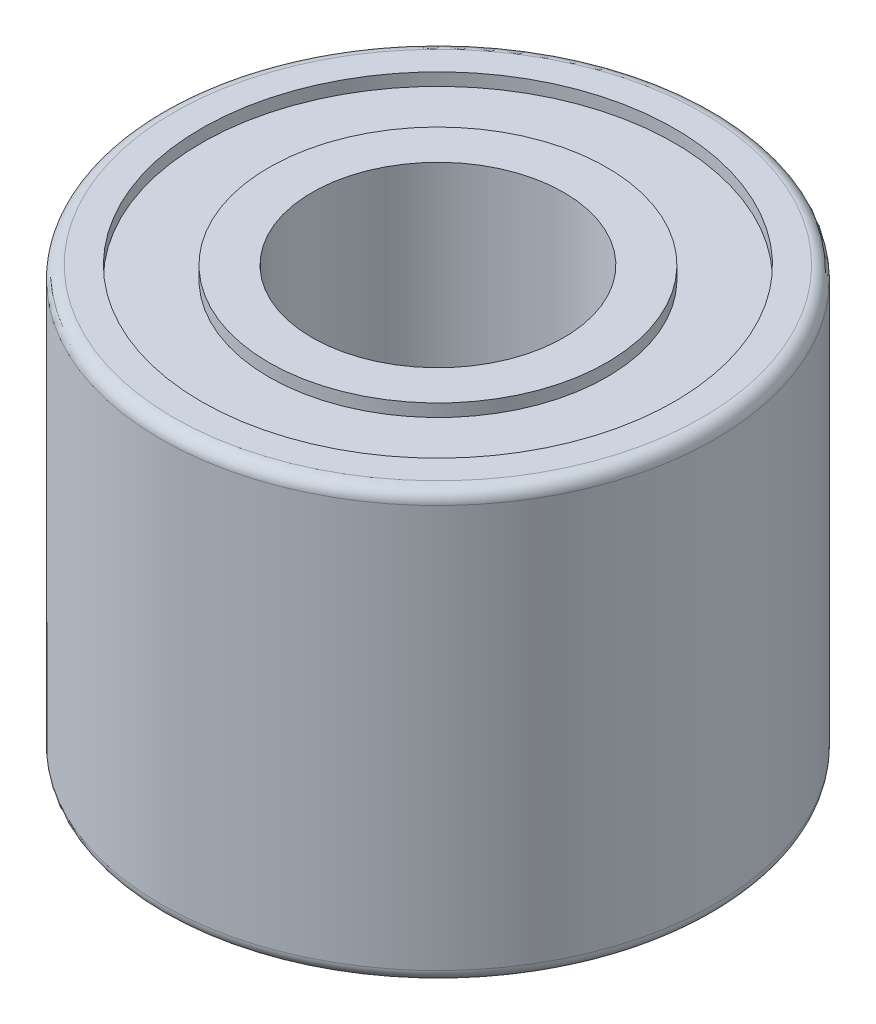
ISO-10303-21;
HEADER;
FILE_DESCRIPTION(('STEP AP214'),'2;1');
FILE_NAME('part.step','',(''),(''),'','','');
FILE_SCHEMA(('AUTOMOTIVE_DESIGN { 1 0 10303 214 1 1 1 1 }'));
ENDSEC;
DATA;
#1=APPLICATION_CONTEXT('core data for automotive mechanical design processes');
#2=APPLICATION_PROTOCOL_DEFINITION('international standard','automotive_design',2000,#1);
#3=PRODUCT_CONTEXT('',#1,'mechanical');
#4=PRODUCT('Part','Part','',(#3));
#5=PRODUCT_RELATED_PRODUCT_CATEGORY('part','',(#4));
#6=PRODUCT_DEFINITION_FORMATION('','',#4);
#7=PRODUCT_DEFINITION_CONTEXT('part definition',#1,'design');
#8=PRODUCT_DEFINITION('design','',#6,#7);
#9=PRODUCT_DEFINITION_SHAPE('','',#8);
#10=(LENGTH_UNIT() NAMED_UNIT(*) SI_UNIT(.MILLI.,.METRE.));
#11=(NAMED_UNIT(*) PLANE_ANGLE_UNIT() SI_UNIT($,.RADIAN.));
#12=(NAMED_UNIT(*) SI_UNIT($,.STERADIAN.) SOLID_ANGLE_UNIT());
#13=UNCERTAINTY_MEASURE_WITH_UNIT(LENGTH_MEASURE(1.E-05),#10,'distance_accuracy_value','');
#14=(GEOMETRIC_REPRESENTATION_CONTEXT(3) GLOBAL_UNCERTAINTY_ASSIGNED_CONTEXT((#13)) GLOBAL_UNIT_ASSIGNED_CONTEXT((#10,
#11,#12)) REPRESENTATION_CONTEXT('',''));
#15=CARTESIAN_POINT('',(0.,0.,0.));
#16=DIRECTION('',(0.,0.,1.));
#17=DIRECTION('',(1.,0.,0.));
#18=AXIS2_PLACEMENT_3D('',#15,#16,#17);
#19=CARTESIAN_POINT('',(0.,17.,0.));
#20=DIRECTION('',(0.,1.,0.));
#21=DIRECTION('',(0.,0.,1.));
#22=AXIS2_PLACEMENT_3D('',#19,#20,#21);
#23=PLANE('',#22);
#24=CARTESIAN_POINT('',(0.,17.,0.));
#25=DIRECTION('',(0.,1.,0.));
#26=DIRECTION('',(0.,0.,1.));
#27=AXIS2_PLACEMENT_3D('',#24,#25,#26);
#28=CIRCLE('',#27,6.715);
#29=CARTESIAN_POINT('',(0.,17.,6.715));
#30=VERTEX_POINT('',#29);
#31=EDGE_CURVE('E67',#30,#30,#28,.T.);
#32=ORIENTED_EDGE('',*,*,#31,.T.);
#33=EDGE_LOOP('',(#32));
#34=FACE_BOUND('',#33,.T.);
#35=CARTESIAN_POINT('',(0.,17.,0.));
#36=DIRECTION('',(0.,1.,0.));
#37=DIRECTION('',(0.,0.,1.));
#38=AXIS2_PLACEMENT_3D('',#35,#36,#37);
#39=CIRCLE('',#38,5.);
#40=CARTESIAN_POINT('',(0.,17.,5.));
#41=VERTEX_POINT('',#40);
#42=EDGE_CURVE('E68',#41,#41,#39,.T.);
#43=ORIENTED_EDGE('',*,*,#42,.F.);
#44=EDGE_LOOP('',(#43));
#45=FACE_BOUND('',#44,.T.);
#46=ADVANCED_FACE('F43',(#34,#45),#23,.T.);
#47=CARTESIAN_POINT('',(0.,17.,0.));
#48=DIRECTION('',(0.,-1.,0.));
#49=DIRECTION('',(0.,0.,-1.));
#50=AXIS2_PLACEMENT_3D('',#47,#48,#49);
#51=CYLINDRICAL_SURFACE('',#50,6.715);
#52=CARTESIAN_POINT('',(0.,16.5,0.));
#53=DIRECTION('',(0.,1.,0.));
#54=DIRECTION('',(0.,0.,1.));
#55=AXIS2_PLACEMENT_3D('',#52,#53,#54);
#56=CIRCLE('',#55,6.715);
#57=CARTESIAN_POINT('',(0.,16.5,6.715));
#58=VERTEX_POINT('',#57);
#59=EDGE_CURVE('E74',#58,#58,#56,.T.);
#60=ORIENTED_EDGE('',*,*,#59,.T.);
#61=EDGE_LOOP('',(#60));
#62=FACE_BOUND('',#61,.T.);
#63=ORIENTED_EDGE('',*,*,#31,.F.);
#64=EDGE_LOOP('',(#63));
#65=FACE_BOUND('',#64,.T.);
#66=ADVANCED_FACE('F120',(#62,#65),#51,.T.);
#67=CARTESIAN_POINT('',(0.,17.,0.));
#68=DIRECTION('',(0.,-1.,0.));
#69=DIRECTION('',(0.,0.,-1.));
#70=AXIS2_PLACEMENT_3D('',#67,#68,#69);
#71=CYLINDRICAL_SURFACE('',#70,5.);
#72=ORIENTED_EDGE('',*,*,#42,.T.);
#73=EDGE_LOOP('',(#72));
#74=FACE_BOUND('',#73,.T.);
#75=CARTESIAN_POINT('',(0.,0.,0.));
#76=DIRECTION('',(0.,1.,0.));
#77=DIRECTION('',(0.,0.,1.));
#78=AXIS2_PLACEMENT_3D('',#75,#76,#77);
#79=CIRCLE('',#78,5.);
#80=CARTESIAN_POINT('',(0.,0.,5.));
#81=VERTEX_POINT('',#80);
#82=EDGE_CURVE('E71',#81,#81,#79,.T.);
#83=ORIENTED_EDGE('',*,*,#82,.F.);
#84=EDGE_LOOP('',(#83));
#85=FACE_BOUND('',#84,.T.);
#86=ADVANCED_FACE('F130',(#74,#85),#71,.F.);
#87=CARTESIAN_POINT('',(0.,16.5,0.));
#88=DIRECTION('',(0.,1.,0.));
#89=DIRECTION('',(0.,0.,1.));
#90=AXIS2_PLACEMENT_3D('',#87,#88,#89);
#91=PLANE('',#90);
#92=ORIENTED_EDGE('',*,*,#59,.F.);
#93=EDGE_LOOP('',(#92));
#94=FACE_BOUND('',#93,.T.);
#95=CARTESIAN_POINT('',(0.,16.5,0.));
#96=DIRECTION('',(0.,1.,0.));
#97=DIRECTION('',(0.,0.,1.));
#98=AXIS2_PLACEMENT_3D('',#95,#96,#97);
#99=CIRCLE('',#98,9.4);
#100=CARTESIAN_POINT('',(0.,16.5,9.4));
#101=VERTEX_POINT('',#100);
#102=EDGE_CURVE('E84',#101,#101,#99,.T.);
#103=ORIENTED_EDGE('',*,*,#102,.T.);
#104=EDGE_LOOP('',(#103));
#105=FACE_BOUND('',#104,.T.);
#106=ADVANCED_FACE('F100',(#94,#105),#91,.T.);
#107=CARTESIAN_POINT('',(0.,0.,0.));
#108=DIRECTION('',(0.,1.,0.));
#109=DIRECTION('',(0.,0.,1.));
#110=AXIS2_PLACEMENT_3D('',#107,#108,#109);
#111=CYLINDRICAL_SURFACE('',#110,9.4);
#112=CARTESIAN_POINT('',(0.,0.,0.));
#113=DIRECTION('',(0.,1.,0.));
#114=DIRECTION('',(0.,0.,1.));
#115=AXIS2_PLACEMENT_3D('',#112,#113,#114);
#116=CIRCLE('',#115,9.4);
#117=CARTESIAN_POINT('',(0.,0.,9.4));
#118=VERTEX_POINT('',#117);
#119=EDGE_CURVE('E87',#118,#118,#116,.T.);
#120=ORIENTED_EDGE('',*,*,#119,.F.);
#121=EDGE_LOOP('',(#120));
#122=FACE_BOUND('',#121,.T.);
#123=CARTESIAN_POINT('',(0.,0.5,0.));
#124=DIRECTION('',(0.,1.,0.));
#125=DIRECTION('',(0.,0.,1.));
#126=AXIS2_PLACEMENT_3D('',#123,#124,#125);
#127=CIRCLE('',#126,9.4);
#128=CARTESIAN_POINT('',(0.,0.5,9.4));
#129=VERTEX_POINT('',#128);
#130=EDGE_CURVE('E79',#129,#129,#127,.T.);
#131=ORIENTED_EDGE('',*,*,#130,.T.);
#132=EDGE_LOOP('',(#131));
#133=FACE_BOUND('',#132,.T.);
#134=ADVANCED_FACE('F96',(#122,#133),#111,.F.);
#135=CARTESIAN_POINT('',(0.,0.,0.));
#136=DIRECTION('',(0.,1.,0.));
#137=DIRECTION('',(0.,0.,1.));
#138=AXIS2_PLACEMENT_3D('',#135,#136,#137);
#139=CYLINDRICAL_SURFACE('',#138,11.);
#140=CARTESIAN_POINT('',(0.,0.5,0.));
#141=DIRECTION('',(0.,1.,0.));
#142=DIRECTION('',(0.,0.,1.));
#143=AXIS2_PLACEMENT_3D('',#140,#141,#142);
#144=CIRCLE('',#143,11.);
#145=CARTESIAN_POINT('',(0.,0.5,11.));
#146=VERTEX_POINT('',#145);
#147=EDGE_CURVE('E54',#146,#146,#144,.T.);
#148=ORIENTED_EDGE('',*,*,#147,.T.);
#149=EDGE_LOOP('',(#148));
#150=FACE_BOUND('',#149,.T.);
#151=CARTESIAN_POINT('',(0.,16.5,0.));
#152=DIRECTION('',(0.,1.,0.));
#153=DIRECTION('',(0.,0.,1.));
#154=AXIS2_PLACEMENT_3D('',#151,#152,#153);
#155=CIRCLE('',#154,11.);
#156=CARTESIAN_POINT('',(0.,16.5,11.));
#157=VERTEX_POINT('',#156);
#158=EDGE_CURVE('E58',#157,#157,#155,.F.);
#159=ORIENTED_EDGE('',*,*,#158,.T.);
#160=EDGE_LOOP('',(#159));
#161=FACE_BOUND('',#160,.T.);
#162=ADVANCED_FACE('F99',(#150,#161),#139,.T.);
#163=CARTESIAN_POINT('',(0.,0.,0.));
#164=DIRECTION('',(0.,1.,0.));
#165=DIRECTION('',(0.,0.,1.));
#166=AXIS2_PLACEMENT_3D('',#163,#164,#165);
#167=PLANE('',#166);
#168=CARTESIAN_POINT('',(0.,0.,0.));
#169=DIRECTION('',(0.,1.,0.));
#170=DIRECTION('',(0.,0.,1.));
#171=AXIS2_PLACEMENT_3D('',#168,#169,#170);
#172=CIRCLE('',#171,10.5);
#173=CARTESIAN_POINT('',(0.,0.,10.5));
#174=VERTEX_POINT('',#173);
#175=EDGE_CURVE('E50',#174,#174,#172,.F.);
#176=ORIENTED_EDGE('',*,*,#175,.T.);
#177=EDGE_LOOP('',(#176));
#178=FACE_BOUND('',#177,.T.);
#179=ORIENTED_EDGE('',*,*,#119,.T.);
#180=EDGE_LOOP('',(#179));
#181=FACE_BOUND('',#180,.T.);
#182=ADVANCED_FACE('F94',(#178,#181),#167,.F.);
#183=CARTESIAN_POINT('',(0.,17.,0.));
#184=DIRECTION('',(0.,1.,0.));
#185=DIRECTION('',(0.,0.,1.));
#186=AXIS2_PLACEMENT_3D('',#183,#184,#185);
#187=PLANE('',#186);
#188=CARTESIAN_POINT('',(0.,17.,0.));
#189=DIRECTION('',(0.,1.,0.));
#190=DIRECTION('',(0.,0.,1.));
#191=AXIS2_PLACEMENT_3D('',#188,#189,#190);
#192=CIRCLE('',#191,10.5);
#193=CARTESIAN_POINT('',(0.,17.,10.5));
#194=VERTEX_POINT('',#193);
#195=EDGE_CURVE('E10',#194,#194,#192,.T.);
#196=ORIENTED_EDGE('',*,*,#195,.T.);
#197=EDGE_LOOP('',(#196));
#198=FACE_BOUND('',#197,.T.);
#199=CARTESIAN_POINT('',(0.,17.,0.));
#200=DIRECTION('',(0.,1.,0.));
#201=DIRECTION('',(0.,0.,1.));
#202=AXIS2_PLACEMENT_3D('',#199,#200,#201);
#203=CIRCLE('',#202,9.4);
#204=CARTESIAN_POINT('',(0.,17.,9.4));
#205=VERTEX_POINT('',#204);
#206=EDGE_CURVE('E88',#205,#205,#203,.T.);
#207=ORIENTED_EDGE('',*,*,#206,.F.);
#208=EDGE_LOOP('',(#207));
#209=FACE_BOUND('',#208,.T.);
#210=ADVANCED_FACE('F137',(#198,#209),#187,.T.);
#211=ORIENTED_EDGE('',*,*,#102,.F.);
#212=EDGE_LOOP('',(#211));
#213=FACE_BOUND('',#212,.T.);
#214=ORIENTED_EDGE('',*,*,#206,.T.);
#215=EDGE_LOOP('',(#214));
#216=FACE_BOUND('',#215,.T.);
#217=ADVANCED_FACE('F102',(#213,#216),#111,.F.);
#218=CARTESIAN_POINT('',(0.,0.,0.));
#219=DIRECTION('',(0.,1.,0.));
#220=DIRECTION('',(0.,0.,1.));
#221=AXIS2_PLACEMENT_3D('',#218,#219,#220);
#222=PLANE('',#221);
#223=CARTESIAN_POINT('',(0.,0.,0.));
#224=DIRECTION('',(0.,1.,0.));
#225=DIRECTION('',(0.,0.,1.));
#226=AXIS2_PLACEMENT_3D('',#223,#224,#225);
#227=CIRCLE('',#226,6.715);
#228=CARTESIAN_POINT('',(0.,0.,6.715));
#229=VERTEX_POINT('',#228);
#230=EDGE_CURVE('E64',#229,#229,#227,.T.);
#231=ORIENTED_EDGE('',*,*,#230,.F.);
#232=EDGE_LOOP('',(#231));
#233=FACE_BOUND('',#232,.T.);
#234=ORIENTED_EDGE('',*,*,#82,.T.);
#235=EDGE_LOOP('',(#234));
#236=FACE_BOUND('',#235,.T.);
#237=ADVANCED_FACE('F117',(#233,#236),#222,.F.);
#238=ORIENTED_EDGE('',*,*,#230,.T.);
#239=EDGE_LOOP('',(#238));
#240=FACE_BOUND('',#239,.T.);
#241=CARTESIAN_POINT('',(0.,0.5,0.));
#242=DIRECTION('',(0.,1.,0.));
#243=DIRECTION('',(0.,0.,1.));
#244=AXIS2_PLACEMENT_3D('',#241,#242,#243);
#245=CIRCLE('',#244,6.715);
#246=CARTESIAN_POINT('',(0.,0.5,6.715));
#247=VERTEX_POINT('',#246);
#248=EDGE_CURVE('E63',#247,#247,#245,.T.);
#249=ORIENTED_EDGE('',*,*,#248,.F.);
#250=EDGE_LOOP('',(#249));
#251=FACE_BOUND('',#250,.T.);
#252=ADVANCED_FACE('F108',(#240,#251),#51,.T.);
#253=CARTESIAN_POINT('',(0.,0.5,0.));
#254=DIRECTION('',(0.,1.,0.));
#255=DIRECTION('',(0.,0.,1.));
#256=AXIS2_PLACEMENT_3D('',#253,#254,#255);
#257=PLANE('',#256);
#258=ORIENTED_EDGE('',*,*,#248,.T.);
#259=EDGE_LOOP('',(#258));
#260=FACE_BOUND('',#259,.T.);
#261=ORIENTED_EDGE('',*,*,#130,.F.);
#262=EDGE_LOOP('',(#261));
#263=FACE_BOUND('',#262,.T.);
#264=ADVANCED_FACE('F105',(#260,#263),#257,.F.);
#265=CARTESIAN_POINT('',(0.,0.5,0.));
#266=DIRECTION('',(0.,1.,0.));
#267=DIRECTION('',(0.,0.,1.));
#268=AXIS2_PLACEMENT_3D('',#265,#266,#267);
#269=TOROIDAL_SURFACE('',#268,10.5,0.5);
#270=ORIENTED_EDGE('',*,*,#175,.F.);
#271=EDGE_LOOP('',(#270));
#272=FACE_BOUND('',#271,.T.);
#273=ORIENTED_EDGE('',*,*,#147,.F.);
#274=EDGE_LOOP('',(#273));
#275=FACE_BOUND('',#274,.T.);
#276=ADVANCED_FACE('F107',(#272,#275),#269,.T.);
#277=CARTESIAN_POINT('',(0.,16.5,0.));
#278=DIRECTION('',(0.,1.,0.));
#279=DIRECTION('',(0.,0.,1.));
#280=AXIS2_PLACEMENT_3D('',#277,#278,#279);
#281=TOROIDAL_SURFACE('',#280,10.5,0.5);
#282=ORIENTED_EDGE('',*,*,#158,.F.);
#283=EDGE_LOOP('',(#282));
#284=FACE_BOUND('',#283,.T.);
#285=ORIENTED_EDGE('',*,*,#195,.F.);
#286=EDGE_LOOP('',(#285));
#287=FACE_BOUND('',#286,.T.);
#288=ADVANCED_FACE('F45',(#284,#287),#281,.T.);
#289=CLOSED_SHELL('',(#46,#66,#86,#106,#134,#162,#182,#210,#217,#237,#252,#264,#276,#288));
#290=MANIFOLD_SOLID_BREP('B2',#289);
#291=ADVANCED_BREP_SHAPE_REPRESENTATION('',(#18,#290),#14);
#292=SHAPE_DEFINITION_REPRESENTATION(#9,#291);
ENDSEC;
END-ISO-10303-21;
